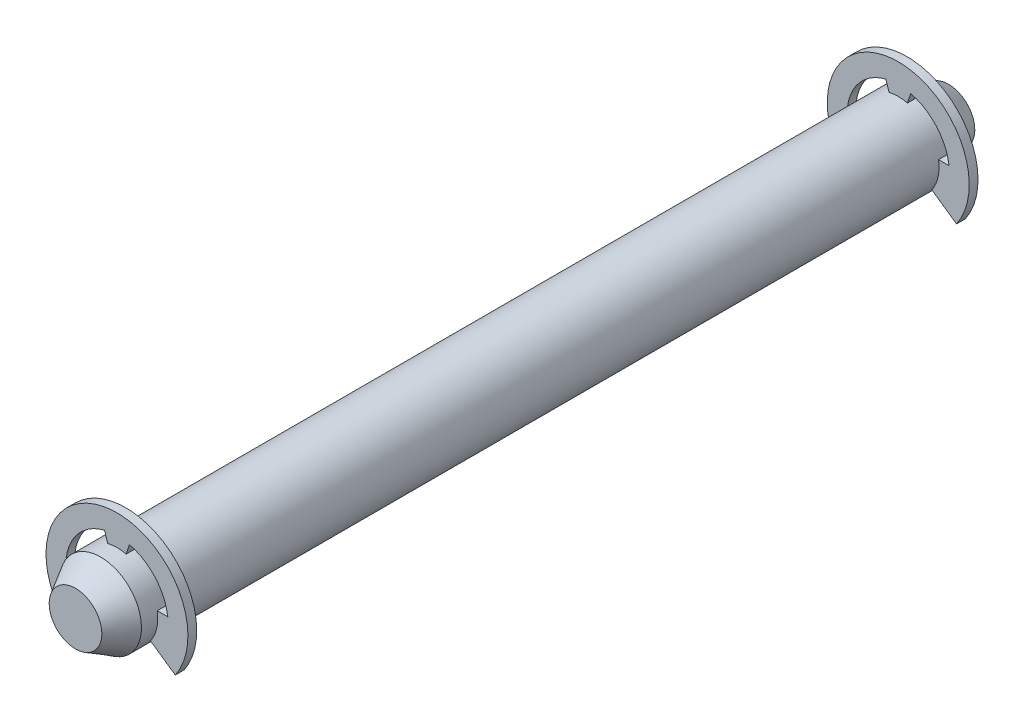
ISO-10303-21;
HEADER;
FILE_DESCRIPTION(('STEP AP214'),'2;1');
FILE_NAME('part.step','',(''),(''),'','','');
FILE_SCHEMA(('AUTOMOTIVE_DESIGN { 1 0 10303 214 1 1 1 1 }'));
ENDSEC;
DATA;
#1=APPLICATION_CONTEXT('core data for automotive mechanical design processes');
#2=APPLICATION_PROTOCOL_DEFINITION('international standard','automotive_design',2000,#1);
#3=PRODUCT_CONTEXT('',#1,'mechanical');
#4=PRODUCT('Part','Part','',(#3));
#5=PRODUCT_RELATED_PRODUCT_CATEGORY('part','',(#4));
#6=PRODUCT_DEFINITION_FORMATION('','',#4);
#7=PRODUCT_DEFINITION_CONTEXT('part definition',#1,'design');
#8=PRODUCT_DEFINITION('design','',#6,#7);
#9=PRODUCT_DEFINITION_SHAPE('','',#8);
#10=(LENGTH_UNIT() NAMED_UNIT(*) SI_UNIT(.MILLI.,.METRE.));
#11=(NAMED_UNIT(*) PLANE_ANGLE_UNIT() SI_UNIT($,.RADIAN.));
#12=(NAMED_UNIT(*) SI_UNIT($,.STERADIAN.) SOLID_ANGLE_UNIT());
#13=UNCERTAINTY_MEASURE_WITH_UNIT(LENGTH_MEASURE(1.E-05),#10,'distance_accuracy_value','');
#14=(GEOMETRIC_REPRESENTATION_CONTEXT(3) GLOBAL_UNCERTAINTY_ASSIGNED_CONTEXT((#13)) GLOBAL_UNIT_ASSIGNED_CONTEXT((#10,
#11,#12)) REPRESENTATION_CONTEXT('',''));
#15=CARTESIAN_POINT('',(0.,0.,0.));
#16=DIRECTION('',(0.,0.,1.));
#17=DIRECTION('',(1.,0.,0.));
#18=AXIS2_PLACEMENT_3D('',#15,#16,#17);
#19=CARTESIAN_POINT('',(0.,0.,69.5));
#20=DIRECTION('',(0.,0.,-1.));
#21=DIRECTION('',(0.,-1.,0.));
#22=AXIS2_PLACEMENT_3D('',#19,#20,#21);
#23=PLANE('',#22);
#24=CARTESIAN_POINT('',(0.,0.,69.500000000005));
#25=DIRECTION('',(0.,0.,-1.));
#26=DIRECTION('',(0.,-1.,0.));
#27=AXIS2_PLACEMENT_3D('',#24,#25,#26);
#28=CIRCLE('',#27,2.09529946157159);
#29=CARTESIAN_POINT('',(0.,-2.0952994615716,69.500000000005));
#30=VERTEX_POINT('',#29);
#31=EDGE_CURVE('E267',#30,#30,#28,.T.);
#32=ORIENTED_EDGE('',*,*,#31,.F.);
#33=EDGE_LOOP('',(#32));
#34=FACE_BOUND('',#33,.T.);
#35=ADVANCED_FACE('F14',(#34),#23,.F.);
#36=CARTESIAN_POINT('',(0.,0.,67.500000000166));
#37=DIRECTION('',(0.,0.,-1.));
#38=DIRECTION('',(0.,-1.,0.));
#39=AXIS2_PLACEMENT_3D('',#36,#37,#38);
#40=CONICAL_SURFACE('',#39,3.2499999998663,0.523598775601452);
#41=CARTESIAN_POINT('',(0.,0.,67.5));
#42=DIRECTION('',(0.,0.,-1.));
#43=DIRECTION('',(0.,-1.,0.));
#44=AXIS2_PLACEMENT_3D('',#41,#42,#43);
#45=CIRCLE('',#44,3.25);
#46=CARTESIAN_POINT('',(0.,-3.25000000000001,67.5));
#47=VERTEX_POINT('',#46);
#48=EDGE_CURVE('E223',#47,#47,#45,.T.);
#49=ORIENTED_EDGE('',*,*,#48,.F.);
#50=EDGE_LOOP('',(#49));
#51=FACE_BOUND('',#50,.T.);
#52=ORIENTED_EDGE('',*,*,#31,.T.);
#53=EDGE_LOOP('',(#52));
#54=FACE_BOUND('',#53,.T.);
#55=ADVANCED_FACE('F444',(#51,#54),#40,.T.);
#56=CARTESIAN_POINT('',(0.,0.,66.2));
#57=DIRECTION('',(0.,0.,-1.));
#58=DIRECTION('',(-1.,0.,0.));
#59=AXIS2_PLACEMENT_3D('',#56,#57,#58);
#60=CYLINDRICAL_SURFACE('',#59,4.075);
#61=CARTESIAN_POINT('',(0.,0.,65.5));
#62=DIRECTION('',(0.,0.,-1.));
#63=DIRECTION('',(-1.,0.,0.));
#64=AXIS2_PLACEMENT_3D('',#61,#62,#63);
#65=CIRCLE('',#64,4.075);
#66=CARTESIAN_POINT('',(-0.991020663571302,3.95265771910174,65.5));
#67=VERTEX_POINT('',#66);
#68=CARTESIAN_POINT('',(-4.04420882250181,0.499999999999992,65.5));
#69=VERTEX_POINT('',#68);
#70=EDGE_CURVE('E206',#67,#69,#65,.F.);
#71=ORIENTED_EDGE('',*,*,#70,.F.);
#72=DIRECTION('',(0.,0.,-1.));
#73=VECTOR('',#72,1.);
#74=CARTESIAN_POINT('',(-0.991020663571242,3.95265771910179,66.2));
#75=LINE('',#74,#73);
#76=CARTESIAN_POINT('',(-0.991020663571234,3.95265771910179,66.2));
#77=VERTEX_POINT('',#76);
#78=EDGE_CURVE('E222',#77,#67,#75,.T.);
#79=ORIENTED_EDGE('',*,*,#78,.F.);
#80=CARTESIAN_POINT('',(0.,0.,66.2));
#81=DIRECTION('',(0.,0.,-1.));
#82=DIRECTION('',(-1.,0.,0.));
#83=AXIS2_PLACEMENT_3D('',#80,#81,#82);
#84=CIRCLE('',#83,4.075);
#85=CARTESIAN_POINT('',(-4.04420882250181,0.499999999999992,66.2));
#86=VERTEX_POINT('',#85);
#87=EDGE_CURVE('E370',#77,#86,#84,.F.);
#88=ORIENTED_EDGE('',*,*,#87,.T.);
#89=DIRECTION('',(0.,0.,-1.));
#90=VECTOR('',#89,1.);
#91=CARTESIAN_POINT('',(-4.044208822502,0.499999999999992,66.2));
#92=LINE('',#91,#90);
#93=EDGE_CURVE('E228',#69,#86,#92,.F.);
#94=ORIENTED_EDGE('',*,*,#93,.F.);
#95=EDGE_LOOP('',(#71,#79,#88,#94));
#96=FACE_BOUND('',#95,.T.);
#97=ADVANCED_FACE('F451',(#96),#60,.F.);
#98=CARTESIAN_POINT('',(0.,0.,66.2));
#99=DIRECTION('',(0.,0.,-1.));
#100=DIRECTION('',(-1.,0.,0.));
#101=AXIS2_PLACEMENT_3D('',#98,#99,#100);
#102=CYLINDRICAL_SURFACE('',#101,5.65);
#103=DIRECTION('',(0.,0.,-1.));
#104=VECTOR('',#103,1.);
#105=CARTESIAN_POINT('',(-4.64430000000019,-3.21760431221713,66.2));
#106=LINE('',#105,#104);
#107=CARTESIAN_POINT('',(-4.64430000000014,-3.21760431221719,65.5));
#108=VERTEX_POINT('',#107);
#109=CARTESIAN_POINT('',(-4.64430000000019,-3.21760431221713,66.2));
#110=VERTEX_POINT('',#109);
#111=EDGE_CURVE('E357',#108,#110,#106,.F.);
#112=ORIENTED_EDGE('',*,*,#111,.T.);
#113=CARTESIAN_POINT('',(0.,0.,66.2));
#114=DIRECTION('',(0.,0.,-1.));
#115=DIRECTION('',(-1.,0.,0.));
#116=AXIS2_PLACEMENT_3D('',#113,#114,#115);
#117=CIRCLE('',#116,5.65);
#118=CARTESIAN_POINT('',(4.6443000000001,-3.21760431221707,66.2));
#119=VERTEX_POINT('',#118);
#120=EDGE_CURVE('E371',#110,#119,#117,.T.);
#121=ORIENTED_EDGE('',*,*,#120,.T.);
#122=DIRECTION('',(0.,0.,-1.));
#123=VECTOR('',#122,1.);
#124=CARTESIAN_POINT('',(4.6443,-3.217604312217,66.2));
#125=LINE('',#124,#123);
#126=CARTESIAN_POINT('',(4.6443000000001,-3.21760431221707,65.5));
#127=VERTEX_POINT('',#126);
#128=EDGE_CURVE('E210',#127,#119,#125,.F.);
#129=ORIENTED_EDGE('',*,*,#128,.F.);
#130=CARTESIAN_POINT('',(0.,0.,65.5));
#131=DIRECTION('',(0.,0.,-1.));
#132=DIRECTION('',(-1.,0.,0.));
#133=AXIS2_PLACEMENT_3D('',#130,#131,#132);
#134=CIRCLE('',#133,5.65);
#135=EDGE_CURVE('E368',#127,#108,#134,.F.);
#136=ORIENTED_EDGE('',*,*,#135,.T.);
#137=EDGE_LOOP('',(#112,#121,#129,#136));
#138=FACE_BOUND('',#137,.T.);
#139=ADVANCED_FACE('F391',(#138),#102,.T.);
#140=CARTESIAN_POINT('',(0.,0.,66.2));
#141=DIRECTION('',(0.,0.,-1.));
#142=DIRECTION('',(-1.,0.,0.));
#143=AXIS2_PLACEMENT_3D('',#140,#141,#142);
#144=CYLINDRICAL_SURFACE('',#143,4.075);
#145=CARTESIAN_POINT('',(0.,0.,65.5));
#146=DIRECTION('',(0.,0.,-1.));
#147=DIRECTION('',(-1.,0.,0.));
#148=AXIS2_PLACEMENT_3D('',#145,#146,#147);
#149=CIRCLE('',#148,4.075);
#150=CARTESIAN_POINT('',(4.04420882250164,0.499999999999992,65.5));
#151=VERTEX_POINT('',#150);
#152=CARTESIAN_POINT('',(0.991020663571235,3.95265771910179,65.5));
#153=VERTEX_POINT('',#152);
#154=EDGE_CURVE('E367',#151,#153,#149,.F.);
#155=ORIENTED_EDGE('',*,*,#154,.F.);
#156=DIRECTION('',(0.,0.,-1.));
#157=VECTOR('',#156,1.);
#158=CARTESIAN_POINT('',(4.04420882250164,0.499999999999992,66.2));
#159=LINE('',#158,#157);
#160=CARTESIAN_POINT('',(4.04420882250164,0.499999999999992,66.2));
#161=VERTEX_POINT('',#160);
#162=EDGE_CURVE('E23',#161,#151,#159,.T.);
#163=ORIENTED_EDGE('',*,*,#162,.F.);
#164=CARTESIAN_POINT('',(0.,0.,66.2));
#165=DIRECTION('',(0.,0.,-1.));
#166=DIRECTION('',(-1.,0.,0.));
#167=AXIS2_PLACEMENT_3D('',#164,#165,#166);
#168=CIRCLE('',#167,4.075);
#169=CARTESIAN_POINT('',(0.991020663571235,3.95265771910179,66.2));
#170=VERTEX_POINT('',#169);
#171=EDGE_CURVE('E362',#161,#170,#168,.F.);
#172=ORIENTED_EDGE('',*,*,#171,.T.);
#173=DIRECTION('',(0.,0.,-1.));
#174=VECTOR('',#173,1.);
#175=CARTESIAN_POINT('',(0.991020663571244,3.95265771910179,66.2));
#176=LINE('',#175,#174);
#177=EDGE_CURVE('E212',#153,#170,#176,.F.);
#178=ORIENTED_EDGE('',*,*,#177,.F.);
#179=EDGE_LOOP('',(#155,#163,#172,#178));
#180=FACE_BOUND('',#179,.T.);
#181=ADVANCED_FACE('F508',(#180),#144,.F.);
#182=CARTESIAN_POINT('',(2.449489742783,0.499999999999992,66.2));
#183=DIRECTION('',(0.,1.,0.));
#184=DIRECTION('',(0.,0.,-1.));
#185=AXIS2_PLACEMENT_3D('',#182,#183,#184);
#186=PLANE('',#185);
#187=DIRECTION('',(-1.,0.,0.));
#188=VECTOR('',#187,1.);
#189=CARTESIAN_POINT('',(2.449489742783,0.499999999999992,65.5));
#190=LINE('',#189,#188);
#191=CARTESIAN_POINT('',(3.21130814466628,0.499999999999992,65.5));
#192=VERTEX_POINT('',#191);
#193=EDGE_CURVE('E9',#151,#192,#190,.T.);
#194=ORIENTED_EDGE('',*,*,#193,.T.);
#195=DIRECTION('',(0.,0.,-1.));
#196=VECTOR('',#195,1.);
#197=CARTESIAN_POINT('',(3.21130814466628,0.49999999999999,75.4423881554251));
#198=LINE('',#197,#196);
#199=CARTESIAN_POINT('',(3.21130814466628,0.499999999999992,66.2));
#200=VERTEX_POINT('',#199);
#201=EDGE_CURVE('E176',#192,#200,#198,.F.);
#202=ORIENTED_EDGE('',*,*,#201,.T.);
#203=DIRECTION('',(-1.,0.,0.));
#204=VECTOR('',#203,1.);
#205=CARTESIAN_POINT('',(0.,0.499999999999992,66.2));
#206=LINE('',#205,#204);
#207=EDGE_CURVE('E201',#200,#161,#206,.F.);
#208=ORIENTED_EDGE('',*,*,#207,.T.);
#209=ORIENTED_EDGE('',*,*,#162,.T.);
#210=EDGE_LOOP('',(#194,#202,#208,#209));
#211=FACE_BOUND('',#210,.T.);
#212=ADVANCED_FACE('F199',(#211),#186,.T.);
#213=CARTESIAN_POINT('',(0.,0.,65.5));
#214=DIRECTION('',(0.,0.,-1.));
#215=DIRECTION('',(-1.,0.,0.));
#216=AXIS2_PLACEMENT_3D('',#213,#214,#215);
#217=PLANE('',#216);
#218=DIRECTION('',(-1.,0.,0.));
#219=VECTOR('',#218,1.);
#220=CARTESIAN_POINT('',(-4.044208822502,0.499999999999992,65.5));
#221=LINE('',#220,#219);
#222=CARTESIAN_POINT('',(-3.21130814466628,0.499999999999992,65.5));
#223=VERTEX_POINT('',#222);
#224=EDGE_CURVE('E227',#223,#69,#221,.T.);
#225=ORIENTED_EDGE('',*,*,#224,.F.);
#226=CARTESIAN_POINT('',(0.,0.,65.5));
#227=DIRECTION('',(0.,0.,-1.));
#228=DIRECTION('',(0.,1.,0.));
#229=AXIS2_PLACEMENT_3D('',#226,#227,#228);
#230=CIRCLE('',#229,3.25);
#231=CARTESIAN_POINT('',(-2.67150000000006,-1.85083433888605,65.5));
#232=VERTEX_POINT('',#231);
#233=EDGE_CURVE('E196',#223,#232,#230,.F.);
#234=ORIENTED_EDGE('',*,*,#233,.T.);
#235=DIRECTION('',(-0.822000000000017,-0.569487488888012,0.));
#236=VECTOR('',#235,1.);
#237=CARTESIAN_POINT('',(-2.055,-1.42371872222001,65.5));
#238=LINE('',#237,#236);
#239=EDGE_CURVE('E231',#108,#232,#238,.F.);
#240=ORIENTED_EDGE('',*,*,#239,.F.);
#241=ORIENTED_EDGE('',*,*,#135,.F.);
#242=DIRECTION('',(-0.822000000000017,0.569487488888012,0.));
#243=VECTOR('',#242,1.);
#244=CARTESIAN_POINT('',(4.6443,-3.217604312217,65.5));
#245=LINE('',#244,#243);
#246=CARTESIAN_POINT('',(2.67150000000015,-1.85083433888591,65.5));
#247=VERTEX_POINT('',#246);
#248=EDGE_CURVE('E193',#247,#127,#245,.F.);
#249=ORIENTED_EDGE('',*,*,#248,.F.);
#250=EDGE_CURVE('E179',#247,#192,#230,.F.);
#251=ORIENTED_EDGE('',*,*,#250,.T.);
#252=ORIENTED_EDGE('',*,*,#193,.F.);
#253=ORIENTED_EDGE('',*,*,#154,.T.);
#254=DIRECTION('',(-0.310510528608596,-0.950569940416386,0.));
#255=VECTOR('',#254,1.);
#256=CARTESIAN_POINT('',(0.991020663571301,3.95265771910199,65.5));
#257=LINE('',#256,#255);
#258=CARTESIAN_POINT('',(0.734058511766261,3.16601612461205,65.5));
#259=VERTEX_POINT('',#258);
#260=EDGE_CURVE('E219',#259,#153,#257,.F.);
#261=ORIENTED_EDGE('',*,*,#260,.F.);
#262=CARTESIAN_POINT('',(-0.734058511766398,3.16601612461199,65.5));
#263=VERTEX_POINT('',#262);
#264=EDGE_CURVE('E197',#259,#263,#230,.F.);
#265=ORIENTED_EDGE('',*,*,#264,.T.);
#266=DIRECTION('',(-0.310510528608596,0.950569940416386,0.));
#267=VECTOR('',#266,1.);
#268=CARTESIAN_POINT('',(-0.5,2.44948974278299,65.5));
#269=LINE('',#268,#267);
#270=EDGE_CURVE('E216',#67,#263,#269,.F.);
#271=ORIENTED_EDGE('',*,*,#270,.F.);
#272=ORIENTED_EDGE('',*,*,#70,.T.);
#273=EDGE_LOOP('',(#225,#234,#240,#241,#249,#251,#252,#253,#261,#265,#271,#272));
#274=FACE_BOUND('',#273,.T.);
#275=ADVANCED_FACE('F189',(#274),#217,.T.);
#276=CARTESIAN_POINT('',(4.6443,-3.217604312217,66.2));
#277=DIRECTION('',(-0.569487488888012,-0.822000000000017,0.));
#278=DIRECTION('',(-0.822000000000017,0.569487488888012,0.));
#279=AXIS2_PLACEMENT_3D('',#276,#277,#278);
#280=PLANE('',#279);
#281=DIRECTION('',(-0.822000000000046,0.569487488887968,0.));
#282=VECTOR('',#281,1.);
#283=CARTESIAN_POINT('',(4.6443,-3.217604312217,66.2));
#284=LINE('',#283,#282);
#285=CARTESIAN_POINT('',(2.67150000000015,-1.85083433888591,66.2));
#286=VERTEX_POINT('',#285);
#287=EDGE_CURVE('E232',#119,#286,#284,.T.);
#288=ORIENTED_EDGE('',*,*,#287,.T.);
#289=DIRECTION('',(0.,0.,-1.));
#290=VECTOR('',#289,1.);
#291=CARTESIAN_POINT('',(2.67150000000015,-1.85083433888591,75.4423881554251));
#292=LINE('',#291,#290);
#293=EDGE_CURVE('E194',#286,#247,#292,.T.);
#294=ORIENTED_EDGE('',*,*,#293,.T.);
#295=ORIENTED_EDGE('',*,*,#248,.T.);
#296=ORIENTED_EDGE('',*,*,#128,.T.);
#297=EDGE_LOOP('',(#288,#294,#295,#296));
#298=FACE_BOUND('',#297,.T.);
#299=ADVANCED_FACE('F401',(#298),#280,.T.);
#300=CARTESIAN_POINT('',(0.,0.,66.2));
#301=DIRECTION('',(0.,0.,-1.));
#302=DIRECTION('',(-1.,0.,0.));
#303=AXIS2_PLACEMENT_3D('',#300,#301,#302);
#304=PLANE('',#303);
#305=CARTESIAN_POINT('',(0.,0.,66.2));
#306=DIRECTION('',(0.,0.,-1.));
#307=DIRECTION('',(0.,1.,0.));
#308=AXIS2_PLACEMENT_3D('',#305,#306,#307);
#309=CIRCLE('',#308,3.25);
#310=CARTESIAN_POINT('',(-3.21130814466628,0.499999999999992,66.2));
#311=VERTEX_POINT('',#310);
#312=CARTESIAN_POINT('',(-2.67150000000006,-1.85083433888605,66.2));
#313=VERTEX_POINT('',#312);
#314=EDGE_CURVE('E406',#311,#313,#309,.F.);
#315=ORIENTED_EDGE('',*,*,#314,.F.);
#316=DIRECTION('',(-1.,0.,0.));
#317=VECTOR('',#316,1.);
#318=CARTESIAN_POINT('',(0.,0.499999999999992,66.2));
#319=LINE('',#318,#317);
#320=EDGE_CURVE('E224',#86,#311,#319,.F.);
#321=ORIENTED_EDGE('',*,*,#320,.F.);
#322=ORIENTED_EDGE('',*,*,#87,.F.);
#323=DIRECTION('',(-0.310510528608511,0.950569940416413,0.));
#324=VECTOR('',#323,1.);
#325=CARTESIAN_POINT('',(-0.5,2.44948974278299,66.2));
#326=LINE('',#325,#324);
#327=CARTESIAN_POINT('',(-0.734058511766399,3.16601612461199,66.2));
#328=VERTEX_POINT('',#327);
#329=EDGE_CURVE('E220',#328,#77,#326,.T.);
#330=ORIENTED_EDGE('',*,*,#329,.F.);
#331=CARTESIAN_POINT('',(0.734058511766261,3.16601612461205,66.2));
#332=VERTEX_POINT('',#331);
#333=EDGE_CURVE('E408',#332,#328,#309,.F.);
#334=ORIENTED_EDGE('',*,*,#333,.F.);
#335=DIRECTION('',(-0.310510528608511,-0.950569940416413,0.));
#336=VECTOR('',#335,1.);
#337=CARTESIAN_POINT('',(0.991020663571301,3.95265771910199,66.2));
#338=LINE('',#337,#336);
#339=EDGE_CURVE('E215',#170,#332,#338,.T.);
#340=ORIENTED_EDGE('',*,*,#339,.F.);
#341=ORIENTED_EDGE('',*,*,#171,.F.);
#342=ORIENTED_EDGE('',*,*,#207,.F.);
#343=EDGE_CURVE('E182',#286,#200,#309,.F.);
#344=ORIENTED_EDGE('',*,*,#343,.F.);
#345=ORIENTED_EDGE('',*,*,#287,.F.);
#346=ORIENTED_EDGE('',*,*,#120,.F.);
#347=DIRECTION('',(-0.822000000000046,-0.569487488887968,0.));
#348=VECTOR('',#347,1.);
#349=CARTESIAN_POINT('',(-2.055,-1.42371872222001,66.2));
#350=LINE('',#349,#348);
#351=EDGE_CURVE('E229',#313,#110,#350,.T.);
#352=ORIENTED_EDGE('',*,*,#351,.F.);
#353=EDGE_LOOP('',(#315,#321,#322,#330,#334,#340,#341,#342,#344,#345,#346,#352));
#354=FACE_BOUND('',#353,.T.);
#355=ADVANCED_FACE('F399',(#354),#304,.F.);
#356=CARTESIAN_POINT('',(-2.055,-1.42371872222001,66.2));
#357=DIRECTION('',(0.569487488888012,-0.822000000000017,0.));
#358=DIRECTION('',(-0.822000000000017,-0.569487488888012,0.));
#359=AXIS2_PLACEMENT_3D('',#356,#357,#358);
#360=PLANE('',#359);
#361=ORIENTED_EDGE('',*,*,#239,.T.);
#362=DIRECTION('',(0.,0.,-1.));
#363=VECTOR('',#362,1.);
#364=CARTESIAN_POINT('',(-2.67150000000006,-1.85083433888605,75.4423881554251));
#365=LINE('',#364,#363);
#366=EDGE_CURVE('E31',#232,#313,#365,.F.);
#367=ORIENTED_EDGE('',*,*,#366,.T.);
#368=ORIENTED_EDGE('',*,*,#351,.T.);
#369=ORIENTED_EDGE('',*,*,#111,.F.);
#370=EDGE_LOOP('',(#361,#367,#368,#369));
#371=FACE_BOUND('',#370,.T.);
#372=ADVANCED_FACE('F402',(#371),#360,.T.);
#373=CARTESIAN_POINT('',(-4.044208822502,0.499999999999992,66.2));
#374=DIRECTION('',(0.,1.,0.));
#375=DIRECTION('',(0.,0.,-1.));
#376=AXIS2_PLACEMENT_3D('',#373,#374,#375);
#377=PLANE('',#376);
#378=ORIENTED_EDGE('',*,*,#320,.T.);
#379=DIRECTION('',(0.,0.,-1.));
#380=VECTOR('',#379,1.);
#381=CARTESIAN_POINT('',(-3.21130814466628,0.49999999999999,75.4423881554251));
#382=LINE('',#381,#380);
#383=EDGE_CURVE('E403',#311,#223,#382,.T.);
#384=ORIENTED_EDGE('',*,*,#383,.T.);
#385=ORIENTED_EDGE('',*,*,#224,.T.);
#386=ORIENTED_EDGE('',*,*,#93,.T.);
#387=EDGE_LOOP('',(#378,#384,#385,#386));
#388=FACE_BOUND('',#387,.T.);
#389=ADVANCED_FACE('F494',(#388),#377,.T.);
#390=CARTESIAN_POINT('',(0.991020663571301,3.95265771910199,66.2));
#391=DIRECTION('',(0.950569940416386,-0.310510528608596,0.));
#392=DIRECTION('',(-0.310510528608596,-0.950569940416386,0.));
#393=AXIS2_PLACEMENT_3D('',#390,#391,#392);
#394=PLANE('',#393);
#395=ORIENTED_EDGE('',*,*,#339,.T.);
#396=DIRECTION('',(0.,0.,-1.));
#397=VECTOR('',#396,1.);
#398=CARTESIAN_POINT('',(0.734058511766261,3.16601612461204,75.4423881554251));
#399=LINE('',#398,#397);
#400=EDGE_CURVE('E676',#332,#259,#399,.T.);
#401=ORIENTED_EDGE('',*,*,#400,.T.);
#402=ORIENTED_EDGE('',*,*,#260,.T.);
#403=ORIENTED_EDGE('',*,*,#177,.T.);
#404=EDGE_LOOP('',(#395,#401,#402,#403));
#405=FACE_BOUND('',#404,.T.);
#406=ADVANCED_FACE('F487',(#405),#394,.T.);
#407=CARTESIAN_POINT('',(-0.5,2.44948974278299,66.2));
#408=DIRECTION('',(-0.950569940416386,-0.310510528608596,0.));
#409=DIRECTION('',(-0.310510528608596,0.950569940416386,0.));
#410=AXIS2_PLACEMENT_3D('',#407,#408,#409);
#411=PLANE('',#410);
#412=ORIENTED_EDGE('',*,*,#270,.T.);
#413=DIRECTION('',(0.,0.,-1.));
#414=VECTOR('',#413,1.);
#415=CARTESIAN_POINT('',(-0.734058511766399,3.16601612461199,75.4423881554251));
#416=LINE('',#415,#414);
#417=EDGE_CURVE('E39',#263,#328,#416,.F.);
#418=ORIENTED_EDGE('',*,*,#417,.T.);
#419=ORIENTED_EDGE('',*,*,#329,.T.);
#420=ORIENTED_EDGE('',*,*,#78,.T.);
#421=EDGE_LOOP('',(#412,#418,#419,#420));
#422=FACE_BOUND('',#421,.T.);
#423=ADVANCED_FACE('F482',(#422),#411,.T.);
#424=CARTESIAN_POINT('',(0.,0.,3.3));
#425=DIRECTION('',(0.,0.,1.));
#426=DIRECTION('',(1.,0.,0.));
#427=AXIS2_PLACEMENT_3D('',#424,#425,#426);
#428=CYLINDRICAL_SURFACE('',#427,4.075);
#429=CARTESIAN_POINT('',(0.,0.,4.));
#430=DIRECTION('',(0.,0.,1.));
#431=DIRECTION('',(1.,0.,0.));
#432=AXIS2_PLACEMENT_3D('',#429,#430,#431);
#433=CIRCLE('',#432,4.075);
#434=CARTESIAN_POINT('',(-4.04420882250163,0.5,4.));
#435=VERTEX_POINT('',#434);
#436=CARTESIAN_POINT('',(-0.991020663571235,3.95265771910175,4.));
#437=VERTEX_POINT('',#436);
#438=EDGE_CURVE('E239',#435,#437,#433,.F.);
#439=ORIENTED_EDGE('',*,*,#438,.F.);
#440=DIRECTION('',(0.,0.,1.));
#441=VECTOR('',#440,1.);
#442=CARTESIAN_POINT('',(-4.04420882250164,0.5,3.3));
#443=LINE('',#442,#441);
#444=CARTESIAN_POINT('',(-4.04420882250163,0.5,3.3));
#445=VERTEX_POINT('',#444);
#446=EDGE_CURVE('E275',#445,#435,#443,.T.);
#447=ORIENTED_EDGE('',*,*,#446,.F.);
#448=CARTESIAN_POINT('',(0.,0.,3.3));
#449=DIRECTION('',(0.,0.,1.));
#450=DIRECTION('',(1.,0.,0.));
#451=AXIS2_PLACEMENT_3D('',#448,#449,#450);
#452=CIRCLE('',#451,4.075);
#453=CARTESIAN_POINT('',(-0.991020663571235,3.95265771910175,3.3));
#454=VERTEX_POINT('',#453);
#455=EDGE_CURVE('E250',#445,#454,#452,.F.);
#456=ORIENTED_EDGE('',*,*,#455,.T.);
#457=DIRECTION('',(0.,0.,1.));
#458=VECTOR('',#457,1.);
#459=CARTESIAN_POINT('',(-0.991020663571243,3.95265771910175,3.3));
#460=LINE('',#459,#458);
#461=EDGE_CURVE('E260',#437,#454,#460,.F.);
#462=ORIENTED_EDGE('',*,*,#461,.F.);
#463=EDGE_LOOP('',(#439,#447,#456,#462));
#464=FACE_BOUND('',#463,.T.);
#465=ADVANCED_FACE('F428',(#464),#428,.F.);
#466=CARTESIAN_POINT('',(0.,0.,3.3));
#467=DIRECTION('',(0.,0.,1.));
#468=DIRECTION('',(1.,0.,0.));
#469=AXIS2_PLACEMENT_3D('',#466,#467,#468);
#470=CYLINDRICAL_SURFACE('',#469,5.65);
#471=DIRECTION('',(0.,0.,1.));
#472=VECTOR('',#471,1.);
#473=CARTESIAN_POINT('',(4.64430000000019,-3.21760431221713,3.3));
#474=LINE('',#473,#472);
#475=CARTESIAN_POINT('',(4.64430000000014,-3.2176043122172,4.));
#476=VERTEX_POINT('',#475);
#477=CARTESIAN_POINT('',(4.64430000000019,-3.21760431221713,3.3));
#478=VERTEX_POINT('',#477);
#479=EDGE_CURVE('E254',#476,#478,#474,.F.);
#480=ORIENTED_EDGE('',*,*,#479,.T.);
#481=CARTESIAN_POINT('',(0.,0.,3.3));
#482=DIRECTION('',(0.,0.,1.));
#483=DIRECTION('',(1.,0.,0.));
#484=AXIS2_PLACEMENT_3D('',#481,#482,#483);
#485=CIRCLE('',#484,5.65);
#486=CARTESIAN_POINT('',(-4.64430000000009,-3.21760431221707,3.3));
#487=VERTEX_POINT('',#486);
#488=EDGE_CURVE('E243',#478,#487,#485,.T.);
#489=ORIENTED_EDGE('',*,*,#488,.T.);
#490=DIRECTION('',(0.,0.,1.));
#491=VECTOR('',#490,1.);
#492=CARTESIAN_POINT('',(-4.6443,-3.217604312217,3.3));
#493=LINE('',#492,#491);
#494=CARTESIAN_POINT('',(-4.64430000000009,-3.21760431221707,4.));
#495=VERTEX_POINT('',#494);
#496=EDGE_CURVE('E285',#495,#487,#493,.F.);
#497=ORIENTED_EDGE('',*,*,#496,.F.);
#498=CARTESIAN_POINT('',(0.,0.,4.));
#499=DIRECTION('',(0.,0.,1.));
#500=DIRECTION('',(1.,0.,0.));
#501=AXIS2_PLACEMENT_3D('',#498,#499,#500);
#502=CIRCLE('',#501,5.65);
#503=EDGE_CURVE('E240',#495,#476,#502,.F.);
#504=ORIENTED_EDGE('',*,*,#503,.T.);
#505=EDGE_LOOP('',(#480,#489,#497,#504));
#506=FACE_BOUND('',#505,.T.);
#507=ADVANCED_FACE('F311',(#506),#470,.T.);
#508=CARTESIAN_POINT('',(0.,0.,3.3));
#509=DIRECTION('',(0.,0.,1.));
#510=DIRECTION('',(1.,0.,0.));
#511=AXIS2_PLACEMENT_3D('',#508,#509,#510);
#512=CYLINDRICAL_SURFACE('',#511,4.075);
#513=CARTESIAN_POINT('',(0.,0.,4.));
#514=DIRECTION('',(0.,0.,1.));
#515=DIRECTION('',(1.,0.,0.));
#516=AXIS2_PLACEMENT_3D('',#513,#514,#515);
#517=CIRCLE('',#516,4.075);
#518=CARTESIAN_POINT('',(0.991020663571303,3.95265771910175,4.));
#519=VERTEX_POINT('',#518);
#520=CARTESIAN_POINT('',(4.04420882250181,0.5,4.));
#521=VERTEX_POINT('',#520);
#522=EDGE_CURVE('E235',#519,#521,#517,.F.);
#523=ORIENTED_EDGE('',*,*,#522,.F.);
#524=DIRECTION('',(0.,0.,1.));
#525=VECTOR('',#524,1.);
#526=CARTESIAN_POINT('',(0.991020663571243,3.95265771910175,3.3));
#527=LINE('',#526,#525);
#528=CARTESIAN_POINT('',(0.991020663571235,3.95265771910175,3.3));
#529=VERTEX_POINT('',#528);
#530=EDGE_CURVE('E261',#529,#519,#527,.T.);
#531=ORIENTED_EDGE('',*,*,#530,.F.);
#532=CARTESIAN_POINT('',(0.,0.,3.3));
#533=DIRECTION('',(0.,0.,1.));
#534=DIRECTION('',(1.,0.,0.));
#535=AXIS2_PLACEMENT_3D('',#532,#533,#534);
#536=CIRCLE('',#535,4.075);
#537=CARTESIAN_POINT('',(4.04420882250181,0.5,3.3));
#538=VERTEX_POINT('',#537);
#539=EDGE_CURVE('E247',#529,#538,#536,.F.);
#540=ORIENTED_EDGE('',*,*,#539,.T.);
#541=DIRECTION('',(0.,0.,1.));
#542=VECTOR('',#541,1.);
#543=CARTESIAN_POINT('',(4.044208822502,0.5,3.3));
#544=LINE('',#543,#542);
#545=EDGE_CURVE('E278',#521,#538,#544,.F.);
#546=ORIENTED_EDGE('',*,*,#545,.F.);
#547=EDGE_LOOP('',(#523,#531,#540,#546));
#548=FACE_BOUND('',#547,.T.);
#549=ADVANCED_FACE('F335',(#548),#512,.F.);
#550=CARTESIAN_POINT('',(0.,0.,0.));
#551=DIRECTION('',(0.,0.,-1.));
#552=DIRECTION('',(0.,-1.,0.));
#553=AXIS2_PLACEMENT_3D('',#550,#551,#552);
#554=PLANE('',#553);
#555=CARTESIAN_POINT('',(0.,0.,-5.68503577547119E-11));
#556=DIRECTION('',(0.,0.,1.));
#557=DIRECTION('',(0.,1.,0.));
#558=AXIS2_PLACEMENT_3D('',#555,#556,#557);
#559=CIRCLE('',#558,2.09529946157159);
#560=CARTESIAN_POINT('',(0.,2.09529946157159,-5.68503429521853E-11));
#561=VERTEX_POINT('',#560);
#562=EDGE_CURVE('E251',#561,#561,#559,.T.);
#563=ORIENTED_EDGE('',*,*,#562,.F.);
#564=EDGE_LOOP('',(#563));
#565=FACE_BOUND('',#564,.T.);
#566=ADVANCED_FACE('F456',(#565),#554,.T.);
#567=CARTESIAN_POINT('',(-2.449489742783,0.5,3.3));
#568=DIRECTION('',(0.,1.,0.));
#569=DIRECTION('',(0.,0.,1.));
#570=AXIS2_PLACEMENT_3D('',#567,#568,#569);
#571=PLANE('',#570);
#572=DIRECTION('',(1.,0.,0.));
#573=VECTOR('',#572,1.);
#574=CARTESIAN_POINT('',(-2.449489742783,0.5,4.));
#575=LINE('',#574,#573);
#576=CARTESIAN_POINT('',(-3.21130814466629,0.5,4.));
#577=VERTEX_POINT('',#576);
#578=EDGE_CURVE('E271',#435,#577,#575,.T.);
#579=ORIENTED_EDGE('',*,*,#578,.T.);
#580=DIRECTION('',(0.,0.,1.));
#581=VECTOR('',#580,1.);
#582=CARTESIAN_POINT('',(-3.21130814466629,0.5,-5.94238815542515));
#583=LINE('',#582,#581);
#584=CARTESIAN_POINT('',(-3.21130814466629,0.5,3.3));
#585=VERTEX_POINT('',#584);
#586=EDGE_CURVE('E351',#577,#585,#583,.F.);
#587=ORIENTED_EDGE('',*,*,#586,.T.);
#588=DIRECTION('',(1.,0.,0.));
#589=VECTOR('',#588,1.);
#590=CARTESIAN_POINT('',(0.,0.5,3.3));
#591=LINE('',#590,#589);
#592=EDGE_CURVE('E18',#585,#445,#591,.F.);
#593=ORIENTED_EDGE('',*,*,#592,.T.);
#594=ORIENTED_EDGE('',*,*,#446,.T.);
#595=EDGE_LOOP('',(#579,#587,#593,#594));
#596=FACE_BOUND('',#595,.T.);
#597=ADVANCED_FACE('F430',(#596),#571,.T.);
#598=CARTESIAN_POINT('',(-4.6443,-3.217604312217,3.3));
#599=DIRECTION('',(0.569487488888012,-0.822000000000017,0.));
#600=DIRECTION('',(0.822000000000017,0.569487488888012,0.));
#601=AXIS2_PLACEMENT_3D('',#598,#599,#600);
#602=PLANE('',#601);
#603=DIRECTION('',(0.822000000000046,0.569487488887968,0.));
#604=VECTOR('',#603,1.);
#605=CARTESIAN_POINT('',(-4.6443,-3.217604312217,3.3));
#606=LINE('',#605,#604);
#607=CARTESIAN_POINT('',(-2.67150000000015,-1.8508343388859,3.3));
#608=VERTEX_POINT('',#607);
#609=EDGE_CURVE('E270',#487,#608,#606,.T.);
#610=ORIENTED_EDGE('',*,*,#609,.T.);
#611=DIRECTION('',(0.,0.,1.));
#612=VECTOR('',#611,1.);
#613=CARTESIAN_POINT('',(-2.67150000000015,-1.8508343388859,-5.94238815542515));
#614=LINE('',#613,#612);
#615=CARTESIAN_POINT('',(-2.67150000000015,-1.8508343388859,4.));
#616=VERTEX_POINT('',#615);
#617=EDGE_CURVE('E301',#608,#616,#614,.T.);
#618=ORIENTED_EDGE('',*,*,#617,.T.);
#619=DIRECTION('',(0.822000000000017,0.569487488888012,0.));
#620=VECTOR('',#619,1.);
#621=CARTESIAN_POINT('',(-4.6443,-3.217604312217,4.));
#622=LINE('',#621,#620);
#623=EDGE_CURVE('E268',#616,#495,#622,.F.);
#624=ORIENTED_EDGE('',*,*,#623,.T.);
#625=ORIENTED_EDGE('',*,*,#496,.T.);
#626=EDGE_LOOP('',(#610,#618,#624,#625));
#627=FACE_BOUND('',#626,.T.);
#628=ADVANCED_FACE('F300',(#627),#602,.T.);
#629=CARTESIAN_POINT('',(0.5,2.449489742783,3.3));
#630=DIRECTION('',(0.950569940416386,-0.310510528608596,0.));
#631=DIRECTION('',(0.310510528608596,0.950569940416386,0.));
#632=AXIS2_PLACEMENT_3D('',#629,#630,#631);
#633=PLANE('',#632);
#634=DIRECTION('',(0.310510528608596,0.950569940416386,0.));
#635=VECTOR('',#634,1.);
#636=CARTESIAN_POINT('',(0.5,2.449489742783,4.));
#637=LINE('',#636,#635);
#638=CARTESIAN_POINT('',(0.734058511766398,3.166016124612,4.));
#639=VERTEX_POINT('',#638);
#640=EDGE_CURVE('E257',#519,#639,#637,.F.);
#641=ORIENTED_EDGE('',*,*,#640,.T.);
#642=DIRECTION('',(0.,0.,1.));
#643=VECTOR('',#642,1.);
#644=CARTESIAN_POINT('',(0.734058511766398,3.166016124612,-5.94238815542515));
#645=LINE('',#644,#643);
#646=CARTESIAN_POINT('',(0.734058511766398,3.166016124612,3.3));
#647=VERTEX_POINT('',#646);
#648=EDGE_CURVE('E342',#639,#647,#645,.F.);
#649=ORIENTED_EDGE('',*,*,#648,.T.);
#650=DIRECTION('',(0.310510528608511,0.950569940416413,0.));
#651=VECTOR('',#650,1.);
#652=CARTESIAN_POINT('',(0.5,2.449489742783,3.3));
#653=LINE('',#652,#651);
#654=EDGE_CURVE('E274',#647,#529,#653,.T.);
#655=ORIENTED_EDGE('',*,*,#654,.T.);
#656=ORIENTED_EDGE('',*,*,#530,.T.);
#657=EDGE_LOOP('',(#641,#649,#655,#656));
#658=FACE_BOUND('',#657,.T.);
#659=ADVANCED_FACE('F341',(#658),#633,.T.);
#660=CARTESIAN_POINT('',(-0.9910206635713,3.952657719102,3.3));
#661=DIRECTION('',(-0.950569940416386,-0.310510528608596,0.));
#662=DIRECTION('',(0.310510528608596,-0.950569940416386,0.));
#663=AXIS2_PLACEMENT_3D('',#660,#661,#662);
#664=PLANE('',#663);
#665=DIRECTION('',(0.310510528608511,-0.950569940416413,0.));
#666=VECTOR('',#665,1.);
#667=CARTESIAN_POINT('',(-0.9910206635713,3.952657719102,3.3));
#668=LINE('',#667,#666);
#669=CARTESIAN_POINT('',(-0.734058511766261,3.16601612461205,3.3));
#670=VERTEX_POINT('',#669);
#671=EDGE_CURVE('E279',#454,#670,#668,.T.);
#672=ORIENTED_EDGE('',*,*,#671,.T.);
#673=DIRECTION('',(0.,0.,1.));
#674=VECTOR('',#673,1.);
#675=CARTESIAN_POINT('',(-0.734058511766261,3.16601612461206,-5.94238815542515));
#676=LINE('',#675,#674);
#677=CARTESIAN_POINT('',(-0.734058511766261,3.16601612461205,4.));
#678=VERTEX_POINT('',#677);
#679=EDGE_CURVE('E345',#670,#678,#676,.T.);
#680=ORIENTED_EDGE('',*,*,#679,.T.);
#681=DIRECTION('',(0.310510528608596,-0.950569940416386,0.));
#682=VECTOR('',#681,1.);
#683=CARTESIAN_POINT('',(-0.9910206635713,3.952657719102,4.));
#684=LINE('',#683,#682);
#685=EDGE_CURVE('E276',#678,#437,#684,.F.);
#686=ORIENTED_EDGE('',*,*,#685,.T.);
#687=ORIENTED_EDGE('',*,*,#461,.T.);
#688=EDGE_LOOP('',(#672,#680,#686,#687));
#689=FACE_BOUND('',#688,.T.);
#690=ADVANCED_FACE('F422',(#689),#664,.T.);
#691=CARTESIAN_POINT('',(0.,0.,4.));
#692=DIRECTION('',(0.,0.,1.));
#693=DIRECTION('',(1.,0.,0.));
#694=AXIS2_PLACEMENT_3D('',#691,#692,#693);
#695=PLANE('',#694);
#696=ORIENTED_EDGE('',*,*,#623,.F.);
#697=CARTESIAN_POINT('',(0.,0.,4.));
#698=DIRECTION('',(0.,0.,1.));
#699=DIRECTION('',(0.,-1.,0.));
#700=AXIS2_PLACEMENT_3D('',#697,#698,#699);
#701=CIRCLE('',#700,3.25);
#702=EDGE_CURVE('E347',#616,#577,#701,.F.);
#703=ORIENTED_EDGE('',*,*,#702,.T.);
#704=ORIENTED_EDGE('',*,*,#578,.F.);
#705=ORIENTED_EDGE('',*,*,#438,.T.);
#706=ORIENTED_EDGE('',*,*,#685,.F.);
#707=EDGE_CURVE('E324',#678,#639,#701,.F.);
#708=ORIENTED_EDGE('',*,*,#707,.T.);
#709=ORIENTED_EDGE('',*,*,#640,.F.);
#710=ORIENTED_EDGE('',*,*,#522,.T.);
#711=DIRECTION('',(1.,0.,0.));
#712=VECTOR('',#711,1.);
#713=CARTESIAN_POINT('',(4.044208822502,0.5,4.));
#714=LINE('',#713,#712);
#715=CARTESIAN_POINT('',(3.21130814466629,0.5,4.));
#716=VERTEX_POINT('',#715);
#717=EDGE_CURVE('E246',#716,#521,#714,.T.);
#718=ORIENTED_EDGE('',*,*,#717,.F.);
#719=CARTESIAN_POINT('',(2.67150000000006,-1.85083433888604,4.));
#720=VERTEX_POINT('',#719);
#721=EDGE_CURVE('E413',#716,#720,#701,.F.);
#722=ORIENTED_EDGE('',*,*,#721,.T.);
#723=DIRECTION('',(0.822000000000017,-0.569487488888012,0.));
#724=VECTOR('',#723,1.);
#725=CARTESIAN_POINT('',(2.055,-1.42371872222,4.));
#726=LINE('',#725,#724);
#727=EDGE_CURVE('E264',#476,#720,#726,.F.);
#728=ORIENTED_EDGE('',*,*,#727,.F.);
#729=ORIENTED_EDGE('',*,*,#503,.F.);
#730=EDGE_LOOP('',(#696,#703,#704,#705,#706,#708,#709,#710,#718,#722,#728,#729));
#731=FACE_BOUND('',#730,.T.);
#732=ADVANCED_FACE('F419',(#731),#695,.T.);
#733=CARTESIAN_POINT('',(2.055,-1.42371872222,3.3));
#734=DIRECTION('',(-0.569487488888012,-0.822000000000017,0.));
#735=DIRECTION('',(0.822000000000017,-0.569487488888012,0.));
#736=AXIS2_PLACEMENT_3D('',#733,#734,#735);
#737=PLANE('',#736);
#738=ORIENTED_EDGE('',*,*,#727,.T.);
#739=DIRECTION('',(0.,0.,1.));
#740=VECTOR('',#739,1.);
#741=CARTESIAN_POINT('',(2.67150000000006,-1.85083433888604,-5.94238815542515));
#742=LINE('',#741,#740);
#743=CARTESIAN_POINT('',(2.67150000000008,-1.850834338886,3.3));
#744=VERTEX_POINT('',#743);
#745=EDGE_CURVE('E318',#720,#744,#742,.F.);
#746=ORIENTED_EDGE('',*,*,#745,.T.);
#747=DIRECTION('',(0.822000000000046,-0.569487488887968,0.));
#748=VECTOR('',#747,1.);
#749=CARTESIAN_POINT('',(2.055,-1.42371872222,3.3));
#750=LINE('',#749,#748);
#751=EDGE_CURVE('E238',#744,#478,#750,.T.);
#752=ORIENTED_EDGE('',*,*,#751,.T.);
#753=ORIENTED_EDGE('',*,*,#479,.F.);
#754=EDGE_LOOP('',(#738,#746,#752,#753));
#755=FACE_BOUND('',#754,.T.);
#756=ADVANCED_FACE('F316',(#755),#737,.T.);
#757=CARTESIAN_POINT('',(0.,0.,3.3));
#758=DIRECTION('',(0.,0.,1.));
#759=DIRECTION('',(1.,0.,0.));
#760=AXIS2_PLACEMENT_3D('',#757,#758,#759);
#761=PLANE('',#760);
#762=CARTESIAN_POINT('',(0.,0.,3.3));
#763=DIRECTION('',(0.,0.,1.));
#764=DIRECTION('',(0.,-1.,0.));
#765=AXIS2_PLACEMENT_3D('',#762,#763,#764);
#766=CIRCLE('',#765,3.25);
#767=EDGE_CURVE('E309',#608,#585,#766,.F.);
#768=ORIENTED_EDGE('',*,*,#767,.F.);
#769=ORIENTED_EDGE('',*,*,#609,.F.);
#770=ORIENTED_EDGE('',*,*,#488,.F.);
#771=ORIENTED_EDGE('',*,*,#751,.F.);
#772=CARTESIAN_POINT('',(3.21130814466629,0.5,3.3));
#773=VERTEX_POINT('',#772);
#774=EDGE_CURVE('E321',#773,#744,#766,.F.);
#775=ORIENTED_EDGE('',*,*,#774,.F.);
#776=DIRECTION('',(1.,0.,0.));
#777=VECTOR('',#776,1.);
#778=CARTESIAN_POINT('',(0.,0.5,3.3));
#779=LINE('',#778,#777);
#780=EDGE_CURVE('E263',#538,#773,#779,.F.);
#781=ORIENTED_EDGE('',*,*,#780,.F.);
#782=ORIENTED_EDGE('',*,*,#539,.F.);
#783=ORIENTED_EDGE('',*,*,#654,.F.);
#784=EDGE_CURVE('E327',#670,#647,#766,.F.);
#785=ORIENTED_EDGE('',*,*,#784,.F.);
#786=ORIENTED_EDGE('',*,*,#671,.F.);
#787=ORIENTED_EDGE('',*,*,#455,.F.);
#788=ORIENTED_EDGE('',*,*,#592,.F.);
#789=EDGE_LOOP('',(#768,#769,#770,#771,#775,#781,#782,#783,#785,#786,#787,#788));
#790=FACE_BOUND('',#789,.T.);
#791=ADVANCED_FACE('F16',(#790),#761,.F.);
#792=CARTESIAN_POINT('',(4.044208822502,0.5,3.3));
#793=DIRECTION('',(0.,1.,0.));
#794=DIRECTION('',(0.,0.,1.));
#795=AXIS2_PLACEMENT_3D('',#792,#793,#794);
#796=PLANE('',#795);
#797=ORIENTED_EDGE('',*,*,#780,.T.);
#798=DIRECTION('',(0.,0.,1.));
#799=VECTOR('',#798,1.);
#800=CARTESIAN_POINT('',(3.21130814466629,0.5,-5.94238815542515));
#801=LINE('',#800,#799);
#802=EDGE_CURVE('E325',#773,#716,#801,.T.);
#803=ORIENTED_EDGE('',*,*,#802,.T.);
#804=ORIENTED_EDGE('',*,*,#717,.T.);
#805=ORIENTED_EDGE('',*,*,#545,.T.);
#806=EDGE_LOOP('',(#797,#803,#804,#805));
#807=FACE_BOUND('',#806,.T.);
#808=ADVANCED_FACE('F330',(#807),#796,.T.);
#809=CARTESIAN_POINT('',(0.,0.,1.99999999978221));
#810=DIRECTION('',(0.,0.,1.));
#811=DIRECTION('',(0.,1.,0.));
#812=AXIS2_PLACEMENT_3D('',#809,#810,#811);
#813=CONICAL_SURFACE('',#812,3.2499999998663,0.523598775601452);
#814=CARTESIAN_POINT('',(0.,0.,2.));
#815=DIRECTION('',(0.,0.,-1.));
#816=DIRECTION('',(0.,-1.,0.));
#817=AXIS2_PLACEMENT_3D('',#814,#815,#816);
#818=CIRCLE('',#817,3.25);
#819=CARTESIAN_POINT('',(0.,-3.25,2.));
#820=VERTEX_POINT('',#819);
#821=EDGE_CURVE('E242',#820,#820,#818,.F.);
#822=ORIENTED_EDGE('',*,*,#821,.F.);
#823=EDGE_LOOP('',(#822));
#824=FACE_BOUND('',#823,.T.);
#825=ORIENTED_EDGE('',*,*,#562,.T.);
#826=EDGE_LOOP('',(#825));
#827=FACE_BOUND('',#826,.T.);
#828=ADVANCED_FACE('F432',(#824,#827),#813,.T.);
#829=CARTESIAN_POINT('',(0.,0.,72.975));
#830=DIRECTION('',(0.,0.,-1.));
#831=DIRECTION('',(0.,-1.,0.));
#832=AXIS2_PLACEMENT_3D('',#829,#830,#831);
#833=CYLINDRICAL_SURFACE('',#832,3.25);
#834=ORIENTED_EDGE('',*,*,#821,.T.);
#835=EDGE_LOOP('',(#834));
#836=FACE_BOUND('',#835,.T.);
#837=ORIENTED_EDGE('',*,*,#802,.F.);
#838=ORIENTED_EDGE('',*,*,#774,.T.);
#839=ORIENTED_EDGE('',*,*,#745,.F.);
#840=ORIENTED_EDGE('',*,*,#721,.F.);
#841=EDGE_LOOP('',(#837,#838,#839,#840));
#842=FACE_BOUND('',#841,.T.);
#843=ORIENTED_EDGE('',*,*,#679,.F.);
#844=ORIENTED_EDGE('',*,*,#784,.T.);
#845=ORIENTED_EDGE('',*,*,#648,.F.);
#846=ORIENTED_EDGE('',*,*,#707,.F.);
#847=EDGE_LOOP('',(#843,#844,#845,#846));
#848=FACE_BOUND('',#847,.T.);
#849=ORIENTED_EDGE('',*,*,#617,.F.);
#850=ORIENTED_EDGE('',*,*,#767,.T.);
#851=ORIENTED_EDGE('',*,*,#586,.F.);
#852=ORIENTED_EDGE('',*,*,#702,.F.);
#853=EDGE_LOOP('',(#849,#850,#851,#852));
#854=FACE_BOUND('',#853,.T.);
#855=ORIENTED_EDGE('',*,*,#293,.F.);
#856=ORIENTED_EDGE('',*,*,#343,.T.);
#857=ORIENTED_EDGE('',*,*,#201,.F.);
#858=ORIENTED_EDGE('',*,*,#250,.F.);
#859=EDGE_LOOP('',(#855,#856,#857,#858));
#860=FACE_BOUND('',#859,.T.);
#861=ORIENTED_EDGE('',*,*,#400,.F.);
#862=ORIENTED_EDGE('',*,*,#333,.T.);
#863=ORIENTED_EDGE('',*,*,#417,.F.);
#864=ORIENTED_EDGE('',*,*,#264,.F.);
#865=EDGE_LOOP('',(#861,#862,#863,#864));
#866=FACE_BOUND('',#865,.T.);
#867=ORIENTED_EDGE('',*,*,#383,.F.);
#868=ORIENTED_EDGE('',*,*,#314,.T.);
#869=ORIENTED_EDGE('',*,*,#366,.F.);
#870=ORIENTED_EDGE('',*,*,#233,.F.);
#871=EDGE_LOOP('',(#867,#868,#869,#870));
#872=FACE_BOUND('',#871,.T.);
#873=ORIENTED_EDGE('',*,*,#48,.T.);
#874=EDGE_LOOP('',(#873));
#875=FACE_BOUND('',#874,.T.);
#876=ADVANCED_FACE('F178',(#836,#842,#848,#854,#860,#866,#872,#875),#833,.T.);
#877=CLOSED_SHELL('',(#35,#55,#97,#139,#181,#212,#275,#299,#355,#372,#389,#406,#423,#465,#507,
#549,#566,#597,#628,#659,#690,#732,#756,#791,#808,#828,#876));
#878=MANIFOLD_SOLID_BREP('B1',#877);
#879=ADVANCED_BREP_SHAPE_REPRESENTATION('',(#18,#878),#14);
#880=SHAPE_DEFINITION_REPRESENTATION(#9,#879);
ENDSEC;
END-ISO-10303-21;
